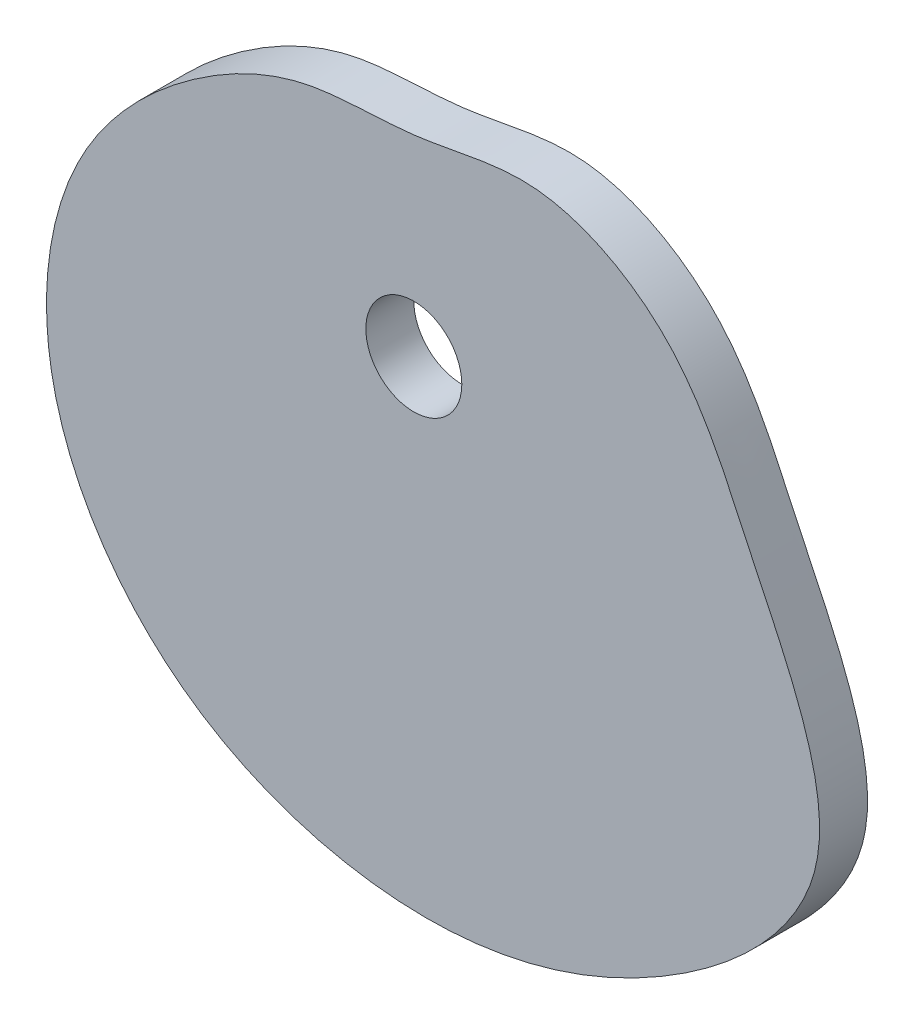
ISO-10303-21;
HEADER;
FILE_DESCRIPTION(('STEP AP214'),'2;1');
FILE_NAME('part.step','',(''),(''),'','','');
FILE_SCHEMA(('AUTOMOTIVE_DESIGN { 1 0 10303 214 1 1 1 1 }'));
ENDSEC;
DATA;
#1=APPLICATION_CONTEXT('core data for automotive mechanical design processes');
#2=APPLICATION_PROTOCOL_DEFINITION('international standard','automotive_design',2000,#1);
#3=PRODUCT_CONTEXT('',#1,'mechanical');
#4=PRODUCT('Part','Part','',(#3));
#5=PRODUCT_RELATED_PRODUCT_CATEGORY('part','',(#4));
#6=PRODUCT_DEFINITION_FORMATION('','',#4);
#7=PRODUCT_DEFINITION_CONTEXT('part definition',#1,'design');
#8=PRODUCT_DEFINITION('design','',#6,#7);
#9=PRODUCT_DEFINITION_SHAPE('','',#8);
#10=(LENGTH_UNIT() NAMED_UNIT(*) SI_UNIT(.MILLI.,.METRE.));
#11=(NAMED_UNIT(*) PLANE_ANGLE_UNIT() SI_UNIT($,.RADIAN.));
#12=(NAMED_UNIT(*) SI_UNIT($,.STERADIAN.) SOLID_ANGLE_UNIT());
#13=UNCERTAINTY_MEASURE_WITH_UNIT(LENGTH_MEASURE(1.E-05),#10,'distance_accuracy_value','');
#14=(GEOMETRIC_REPRESENTATION_CONTEXT(3) GLOBAL_UNCERTAINTY_ASSIGNED_CONTEXT((#13)) GLOBAL_UNIT_ASSIGNED_CONTEXT((#10,
#11,#12)) REPRESENTATION_CONTEXT('',''));
#15=CARTESIAN_POINT('',(0.,0.,0.));
#16=DIRECTION('',(0.,0.,1.));
#17=DIRECTION('',(1.,0.,0.));
#18=AXIS2_PLACEMENT_3D('',#15,#16,#17);
#19=CARTESIAN_POINT('',(8.0388884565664,-99.8809051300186,10.));
#20=DIRECTION('',(0.,0.,-1.));
#21=DIRECTION('',(-1.,0.,0.));
#22=AXIS2_PLACEMENT_3D('',#19,#20,#21);
#23=PLANE('',#22);
#24=CARTESIAN_POINT('',(0.,40.,10.));
#25=CARTESIAN_POINT('',(-7.37209174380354,39.1030724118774,10.));
#26=CARTESIAN_POINT('',(-23.770014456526,39.775120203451,10.));
#27=CARTESIAN_POINT('',(-49.7561426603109,26.5246261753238,10.));
#28=CARTESIAN_POINT('',(-74.9450262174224,0.0125698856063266,10.));
#29=CARTESIAN_POINT('',(-80.2025667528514,-46.3215353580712,10.));
#30=CARTESIAN_POINT('',(-51.0560441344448,-89.2072193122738,10.));
#31=CARTESIAN_POINT('',(0.850039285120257,-104.829863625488,10.));
#32=CARTESIAN_POINT('',(50.4414623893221,-91.7559462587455,10.));
#33=CARTESIAN_POINT('',(96.2574599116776,-50.8909894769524,10.));
#34=CARTESIAN_POINT('',(71.2354049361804,-4.35070961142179,10.));
#35=CARTESIAN_POINT('',(56.5136432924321,30.906412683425,10.));
#36=CARTESIAN_POINT('',(26.5268850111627,46.6845932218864,10.));
#37=CARTESIAN_POINT('',(8.40282752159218,41.0223323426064,10.));
#38=CARTESIAN_POINT('',(0.,40.,10.));
#39=B_SPLINE_CURVE_WITH_KNOTS('',3,(#24,#25,#26,#27,#28,#29,#30,#31,#32,#33,#34,#35,#36,#37,
#38),.UNSPECIFIED.,.T.,.F.,(4,1,1,1,1,1,1,1,1,1,1,1,4),(0.,0.0468679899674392,0.102880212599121,
0.179523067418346,0.271367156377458,0.375520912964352,0.482867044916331,0.592474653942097,
0.700656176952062,0.80877526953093,0.883001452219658,0.946579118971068,1.),.UNSPECIFIED.);
#40=CARTESIAN_POINT('',(0.,40.,10.));
#41=VERTEX_POINT('',#40);
#42=EDGE_CURVE('E10',#41,#41,#39,.T.);
#43=ORIENTED_EDGE('',*,*,#42,.T.);
#44=EDGE_LOOP('',(#43));
#45=FACE_BOUND('',#44,.T.);
#46=CARTESIAN_POINT('',(0.,0.,10.));
#47=DIRECTION('',(0.,0.,1.));
#48=DIRECTION('',(1.,0.,0.));
#49=AXIS2_PLACEMENT_3D('',#46,#47,#48);
#50=CIRCLE('',#49,10.);
#51=CARTESIAN_POINT('',(10.,0.,10.));
#52=VERTEX_POINT('',#51);
#53=EDGE_CURVE('E43',#52,#52,#50,.T.);
#54=ORIENTED_EDGE('',*,*,#53,.F.);
#55=EDGE_LOOP('',(#54));
#56=FACE_BOUND('',#55,.T.);
#57=ADVANCED_FACE('F29',(#45,#56),#23,.F.);
#58=CARTESIAN_POINT('',(8.0388884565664,-99.8809051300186,0.));
#59=DIRECTION('',(0.,0.,-1.));
#60=DIRECTION('',(-1.,0.,0.));
#61=AXIS2_PLACEMENT_3D('',#58,#59,#60);
#62=PLANE('',#61);
#63=CARTESIAN_POINT('',(0.,40.,0.));
#64=CARTESIAN_POINT('',(-7.37209174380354,39.1030724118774,0.));
#65=CARTESIAN_POINT('',(-23.770014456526,39.775120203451,0.));
#66=CARTESIAN_POINT('',(-49.7561426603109,26.5246261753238,0.));
#67=CARTESIAN_POINT('',(-74.9450262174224,0.0125698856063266,0.));
#68=CARTESIAN_POINT('',(-80.2025667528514,-46.3215353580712,0.));
#69=CARTESIAN_POINT('',(-51.0560441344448,-89.2072193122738,0.));
#70=CARTESIAN_POINT('',(0.850039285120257,-104.829863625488,0.));
#71=CARTESIAN_POINT('',(50.4414623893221,-91.7559462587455,0.));
#72=CARTESIAN_POINT('',(96.2574599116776,-50.8909894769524,0.));
#73=CARTESIAN_POINT('',(71.2354049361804,-4.35070961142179,0.));
#74=CARTESIAN_POINT('',(56.5136432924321,30.906412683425,0.));
#75=CARTESIAN_POINT('',(26.5268850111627,46.6845932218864,0.));
#76=CARTESIAN_POINT('',(8.40282752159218,41.0223323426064,0.));
#77=CARTESIAN_POINT('',(0.,40.,0.));
#78=B_SPLINE_CURVE_WITH_KNOTS('',3,(#63,#64,#65,#66,#67,#68,#69,#70,#71,#72,#73,#74,#75,#76,
#77),.UNSPECIFIED.,.T.,.F.,(4,1,1,1,1,1,1,1,1,1,1,1,4),(0.,0.0468679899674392,0.102880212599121,
0.179523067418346,0.271367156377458,0.375520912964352,0.482867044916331,0.592474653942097,
0.700656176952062,0.80877526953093,0.883001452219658,0.946579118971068,1.),.UNSPECIFIED.);
#79=CARTESIAN_POINT('',(0.,40.,0.));
#80=VERTEX_POINT('',#79);
#81=EDGE_CURVE('E39',#80,#80,#78,.T.);
#82=ORIENTED_EDGE('',*,*,#81,.F.);
#83=EDGE_LOOP('',(#82));
#84=FACE_BOUND('',#83,.T.);
#85=CARTESIAN_POINT('',(0.,0.,0.));
#86=DIRECTION('',(0.,0.,1.));
#87=DIRECTION('',(1.,0.,0.));
#88=AXIS2_PLACEMENT_3D('',#85,#86,#87);
#89=CIRCLE('',#88,10.);
#90=CARTESIAN_POINT('',(10.,0.,0.));
#91=VERTEX_POINT('',#90);
#92=EDGE_CURVE('E47',#91,#91,#89,.T.);
#93=ORIENTED_EDGE('',*,*,#92,.T.);
#94=EDGE_LOOP('',(#93));
#95=FACE_BOUND('',#94,.T.);
#96=ADVANCED_FACE('F58',(#84,#95),#62,.T.);
#97=DIRECTION('',(0.,0.,-1.));
#98=VECTOR('',#97,1.);
#99=SURFACE_OF_LINEAR_EXTRUSION('',#39,#98);
#100=ORIENTED_EDGE('',*,*,#42,.F.);
#101=EDGE_LOOP('',(#100));
#102=FACE_BOUND('',#101,.T.);
#103=ORIENTED_EDGE('',*,*,#81,.T.);
#104=EDGE_LOOP('',(#103));
#105=FACE_BOUND('',#104,.T.);
#106=ADVANCED_FACE('F31',(#102,#105),#99,.F.);
#107=CARTESIAN_POINT('',(0.,0.,10.));
#108=DIRECTION('',(0.,0.,-1.));
#109=DIRECTION('',(-1.,0.,0.));
#110=AXIS2_PLACEMENT_3D('',#107,#108,#109);
#111=CYLINDRICAL_SURFACE('',#110,10.);
#112=ORIENTED_EDGE('',*,*,#53,.T.);
#113=EDGE_LOOP('',(#112));
#114=FACE_BOUND('',#113,.T.);
#115=ORIENTED_EDGE('',*,*,#92,.F.);
#116=EDGE_LOOP('',(#115));
#117=FACE_BOUND('',#116,.T.);
#118=ADVANCED_FACE('F60',(#114,#117),#111,.F.);
#119=CLOSED_SHELL('',(#57,#96,#106,#118));
#120=MANIFOLD_SOLID_BREP('B2',#119);
#121=ADVANCED_BREP_SHAPE_REPRESENTATION('',(#18,#120),#14);
#122=SHAPE_DEFINITION_REPRESENTATION(#9,#121);
ENDSEC;
END-ISO-10303-21;
